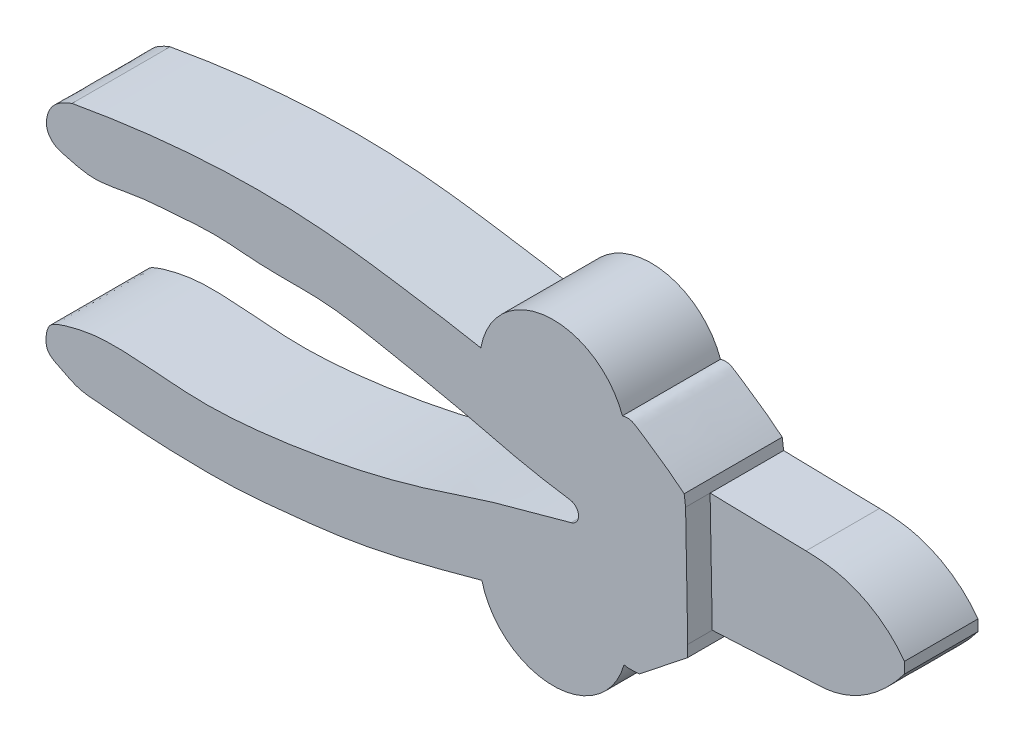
from build123d import *

# Parameters (mm, degrees)
BOSS_EXTRU_2_DEPTH           = 10
BOSS_EXTRU_2_DEPTH_BACK      = 10
ENL_V_MAT_EXTRU_1_DEPTH      = 184.244744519
ENL_V_MAT_EXTRU_1_DEPTH_BACK = 5
BOSS_EXTRU_3_DEPTH           = 20


with BuildPart() as part:
    # Esquisse1 → Boss.-Extru.2 (new, two sides: drawn at the far end of the back side and taken through both)
    with BuildSketch(Plane.XY.offset(-BOSS_EXTRU_2_DEPTH_BACK)):
        with BuildLine():
            Line((130.959159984, 51.370048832), (150.519113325, 50.92976945))
            add(Edge.make_bspline(
                [(150.519113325, 50.92976945), (152.94442535, 50.875177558), (160.682355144, 50.252950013), (167.554511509, 45.69016824), (170.604350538, 41.456038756)],
                knots=[0, 0, 0, 0, 0.318044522, 1, 1, 1, 1], degree=3))
            Line((170.604350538, 41.456038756), (170.604350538, 39.20769132))
            add(Edge.make_bspline(
                [(154.319460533, 28.528585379), (161.049603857, 29.196230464), (166.705993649, 34.011421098), (170.604350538, 39.20769132)],
                knots=[0, 0, 0, 0, 1, 1, 1, 1], degree=3))
            Line((154.319460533, 28.528585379), (131.399218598, 27.354958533))
            Line((131.399218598, 27.354958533), (131.399218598, 25.016852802))
            Line((131.399218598, 25.016852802), (121.535114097, 17.182205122))
            add(Edge.make_bspline(
                [(107.631043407, 36.968856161), (105.514246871, 36.416675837), (99.904669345, 34.80289386), (91.052678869, 32.546629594), (79.492976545, 28.519400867), (64.985410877, 24.466117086), (47.940083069, 21.518679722), (30.321944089, 19.997167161), (16.327822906, 22.092266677), (8.129087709, 21.207067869), (2.504489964, 19.654513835), (0.667360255, 18.387392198), (0.232748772, 13.58433007), (3.599073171, 12.219831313), (7.07276903, 10.075229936), (13.144599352, 9.889923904), (20.488814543, 9.047978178), (28.75955672, 8.796376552), (38.905564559, 8.639959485), (50.154878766, 9.699089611), (64.170489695, 11.294824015), (78.580250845, 14.663397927), (91.520854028, 18.275141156), (100.45765443, 20.614776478), (106.045114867, 21.808880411), (109.853661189, 20.515270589), (113.649038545, 20.064782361), (116.229044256, 18.244956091), (118.917311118, 16.899909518), (120.576107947, 17.153717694), (121.535114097, 17.182205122)],
                knots=[0.08102806, 0.08102806, 0.08102806, 0.08102806, 0.106672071, 0.149466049, 0.188046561, 0.250096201, 0.325958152, 0.389911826, 0.459083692, 0.48240342, 0.497912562, 0.508619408, 0.515569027, 0.5272353, 0.541796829, 0.566367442, 0.594733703, 0.629745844, 0.662872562, 0.713748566, 0.761990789, 0.828130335, 0.887058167, 0.918984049, 0.937487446, 0.952094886, 0.965348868, 0.981602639, 0.988450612, 1, 1, 1, 1], degree=3))
            ThreePointArc((107.631043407, 36.968856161), (109.123036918, 39.016944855), (107.40978889, 40.883892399))
            add(Edge.make_bspline(
                [(5.816286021, 60.124982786), (4.353886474, 59.583120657), (1.871702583, 58.378761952), (0.655888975, 55.485206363), (0.460769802, 53.195363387), (1.787666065, 50.832278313), (5.403471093, 49.934249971), (9.05328386, 48.95237075), (13.902602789, 49.350780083), (19.490378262, 50.563291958), (27.130704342, 51.052789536), (35.489163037, 51.762141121), (45.661347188, 50.545738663), (57.823412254, 51.250993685), (70.820013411, 48.500904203), (83.680363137, 46.065801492), (95.40136373, 42.946898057), (103.513106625, 41.442013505), (107.40978889, 40.883892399)],
                knots=[0, 0, 0, 0, 0.034560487, 0.054057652, 0.064468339, 0.083332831, 0.105795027, 0.140989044, 0.164717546, 0.208938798, 0.263787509, 0.328630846, 0.388382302, 0.48279708, 0.588359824, 0.671565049, 0.763907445, 0.848334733, 0.848334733, 0.848334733, 0.848334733], degree=3))
            add(Edge.make_bspline(
                [(5.816286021, 60.124982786), (15.698832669, 61.903995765), (33.002615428, 64.074147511), (56.278194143, 63.814112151), (75.762776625, 60.919049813), (90.805080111, 58.559276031), (101.150123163, 55.817356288), (106.321528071, 56.079587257), (110.012577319, 56.793500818), (113.853404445, 58.293586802), (116.655805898, 60.78643478), (119.574863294, 61.461229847), (124.102974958, 58.47478265), (127.582049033, 56.174558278), (130.670341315, 53.596986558)],
                knots=[0, 0, 0, 0, 0.233310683, 0.404325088, 0.538893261, 0.690231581, 0.759187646, 0.784833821, 0.809721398, 0.846568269, 0.878534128, 0.896799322, 0.910073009, 1, 1, 1, 1], degree=3))
            Line((130.670341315, 53.596986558), (130.959159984, 51.370048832))
        make_face()
    extrude(amount=BOSS_EXTRU_2_DEPTH + BOSS_EXTRU_2_DEPTH_BACK)

    # Esquisse2 → Enl_v. mat.-Extru.1 (cut, two sides: drawn at the far end of the back side and taken through both)
    with BuildSketch(Plane.XY.offset(10).offset(-ENL_V_MAT_EXTRU_1_DEPTH_BACK)):
        with BuildLine():
            Line((150.519113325, 50.92976945), (130.959159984, 51.370048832))
            Line((130.959159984, 51.370048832), (131.399218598, 27.354958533))
            Line((131.399218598, 27.354958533), (154.319460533, 28.528585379))
            add(Edge.make_bspline(
                [(154.319460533, 28.528585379), (161.049603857, 29.196230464), (166.705993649, 34.011421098), (170.604350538, 39.20769132)],
                knots=[0, 0, 0, 0, 1, 1, 1, 1], degree=3))
            Line((170.604350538, 39.20769132), (170.604350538, 41.456038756))
            add(Edge.make_bspline(
                [(170.604350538, 41.456038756), (167.554511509, 45.69016824), (160.682355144, 50.252950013), (152.94442535, 50.875177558), (150.519113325, 50.92976945)],
                knots=[0, 0, 0, 0, 0.681955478, 1, 1, 1, 1], degree=3))
        make_face()
    extrude(amount=ENL_V_MAT_EXTRU_1_DEPTH + ENL_V_MAT_EXTRU_1_DEPTH_BACK, mode=Mode.SUBTRACT)

    # Esquisse3 → Boss.-Extru.3 (add)
    with BuildSketch(Plane(origin=(0, 0, -10), x_dir=(-1, 0, 0), z_dir=(0, 0, -1))):
        with BuildLine():
            Line((-118.226119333, 51.364174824), (-89.174360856, 53.464265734))
            ThreePointArc((-89.174360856, 53.464265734), (-105.040656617, 70.956968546), (-118.226119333, 51.364174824))
        make_face()
        with BuildLine():
            Line((-117.362341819, 28.038006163), (-89.295209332, 24.46071637))
            ThreePointArc((-89.295209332, 24.46071637), (-105.855639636, 6.423785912), (-117.362341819, 28.038006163))
        make_face()
    extrude(amount=-BOSS_EXTRU_3_DEPTH)


solid = part.part
